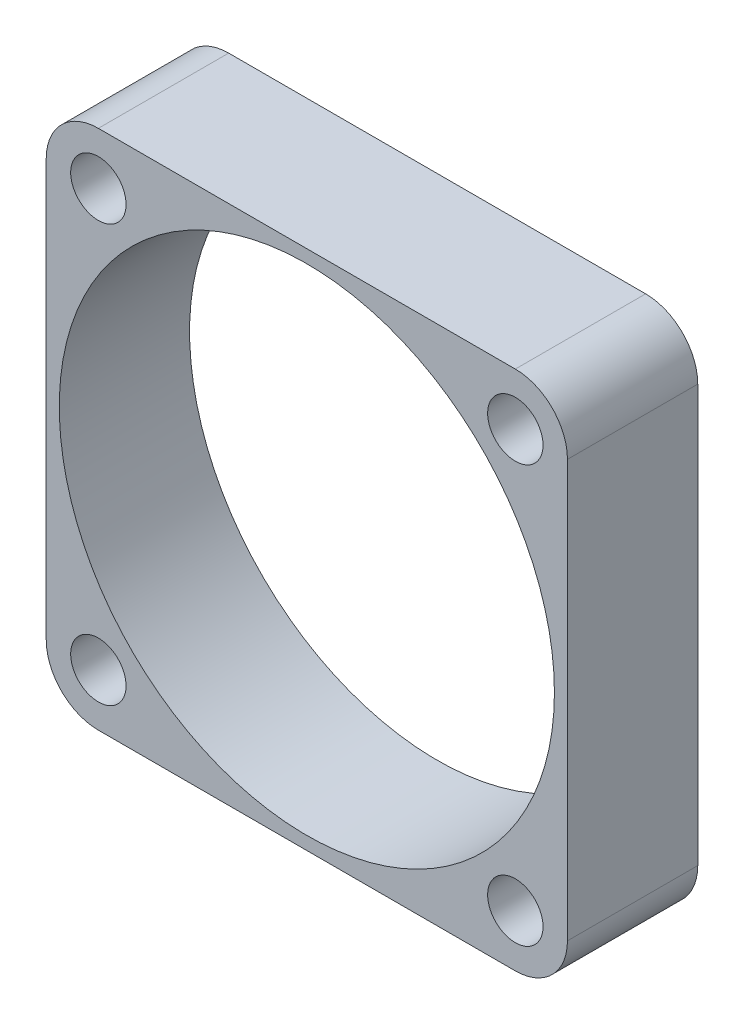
ISO-10303-21;
HEADER;
FILE_DESCRIPTION(('STEP AP214'),'2;1');
FILE_NAME('part.step','',(''),(''),'','','');
FILE_SCHEMA(('AUTOMOTIVE_DESIGN { 1 0 10303 214 1 1 1 1 }'));
ENDSEC;
DATA;
#1=APPLICATION_CONTEXT('core data for automotive mechanical design processes');
#2=APPLICATION_PROTOCOL_DEFINITION('international standard','automotive_design',2000,#1);
#3=PRODUCT_CONTEXT('',#1,'mechanical');
#4=PRODUCT('Part','Part','',(#3));
#5=PRODUCT_RELATED_PRODUCT_CATEGORY('part','',(#4));
#6=PRODUCT_DEFINITION_FORMATION('','',#4);
#7=PRODUCT_DEFINITION_CONTEXT('part definition',#1,'design');
#8=PRODUCT_DEFINITION('design','',#6,#7);
#9=PRODUCT_DEFINITION_SHAPE('','',#8);
#10=(LENGTH_UNIT() NAMED_UNIT(*) SI_UNIT(.MILLI.,.METRE.));
#11=(NAMED_UNIT(*) PLANE_ANGLE_UNIT() SI_UNIT($,.RADIAN.));
#12=(NAMED_UNIT(*) SI_UNIT($,.STERADIAN.) SOLID_ANGLE_UNIT());
#13=UNCERTAINTY_MEASURE_WITH_UNIT(LENGTH_MEASURE(1.E-05),#10,'distance_accuracy_value','');
#14=(GEOMETRIC_REPRESENTATION_CONTEXT(3) GLOBAL_UNCERTAINTY_ASSIGNED_CONTEXT((#13)) GLOBAL_UNIT_ASSIGNED_CONTEXT((#10,
#11,#12)) REPRESENTATION_CONTEXT('',''));
#15=CARTESIAN_POINT('',(0.,0.,0.));
#16=DIRECTION('',(0.,0.,1.));
#17=DIRECTION('',(1.,0.,0.));
#18=AXIS2_PLACEMENT_3D('',#15,#16,#17);
#19=CARTESIAN_POINT('',(0.,0.,10.));
#20=DIRECTION('',(0.,0.,1.));
#21=DIRECTION('',(1.,0.,0.));
#22=AXIS2_PLACEMENT_3D('',#19,#20,#21);
#23=PLANE('',#22);
#24=CARTESIAN_POINT('',(-54.6379845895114,0.,10.));
#25=DIRECTION('',(0.,0.,1.));
#26=DIRECTION('',(1.,0.,0.));
#27=AXIS2_PLACEMENT_3D('',#24,#25,#26);
#28=CIRCLE('',#27,2.125);
#29=CARTESIAN_POINT('',(-52.5129845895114,0.,10.));
#30=VERTEX_POINT('',#29);
#31=EDGE_CURVE('E192',#30,#30,#28,.T.);
#32=ORIENTED_EDGE('',*,*,#31,.F.);
#33=EDGE_LOOP('',(#32));
#34=FACE_BOUND('',#33,.T.);
#35=CARTESIAN_POINT('',(-54.6379845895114,32.,10.));
#36=DIRECTION('',(0.,0.,1.));
#37=DIRECTION('',(1.,0.,0.));
#38=AXIS2_PLACEMENT_3D('',#35,#36,#37);
#39=CIRCLE('',#38,2.125);
#40=CARTESIAN_POINT('',(-52.5129845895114,32.,10.));
#41=VERTEX_POINT('',#40);
#42=EDGE_CURVE('E180',#41,#41,#39,.T.);
#43=ORIENTED_EDGE('',*,*,#42,.F.);
#44=EDGE_LOOP('',(#43));
#45=FACE_BOUND('',#44,.T.);
#46=DIRECTION('',(0.,-1.,0.));
#47=VECTOR('',#46,1.);
#48=CARTESIAN_POINT('',(-58.6379845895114,36.,10.));
#49=LINE('',#48,#47);
#50=CARTESIAN_POINT('',(-58.6379845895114,32.,10.));
#51=VERTEX_POINT('',#50);
#52=CARTESIAN_POINT('',(-58.6379845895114,0.,10.));
#53=VERTEX_POINT('',#52);
#54=EDGE_CURVE('E137',#51,#53,#49,.T.);
#55=ORIENTED_EDGE('',*,*,#54,.T.);
#56=CARTESIAN_POINT('',(-54.6379845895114,0.,10.));
#57=DIRECTION('',(0.,0.,1.));
#58=DIRECTION('',(1.,0.,0.));
#59=AXIS2_PLACEMENT_3D('',#56,#57,#58);
#60=CIRCLE('',#59,4.);
#61=CARTESIAN_POINT('',(-54.6379845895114,-4.00000000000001,10.));
#62=VERTEX_POINT('',#61);
#63=EDGE_CURVE('E152',#53,#62,#60,.T.);
#64=ORIENTED_EDGE('',*,*,#63,.T.);
#65=DIRECTION('',(1.,0.,0.));
#66=VECTOR('',#65,1.);
#67=CARTESIAN_POINT('',(-58.6379845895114,-4.00000000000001,10.));
#68=LINE('',#67,#66);
#69=CARTESIAN_POINT('',(-22.6379845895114,-4.,10.));
#70=VERTEX_POINT('',#69);
#71=EDGE_CURVE('E119',#62,#70,#68,.T.);
#72=ORIENTED_EDGE('',*,*,#71,.T.);
#73=CARTESIAN_POINT('',(-22.6379845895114,0.,10.));
#74=DIRECTION('',(0.,0.,1.));
#75=DIRECTION('',(1.,0.,0.));
#76=AXIS2_PLACEMENT_3D('',#73,#74,#75);
#77=CIRCLE('',#76,4.);
#78=CARTESIAN_POINT('',(-18.6379845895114,0.,10.));
#79=VERTEX_POINT('',#78);
#80=EDGE_CURVE('E150',#70,#79,#77,.T.);
#81=ORIENTED_EDGE('',*,*,#80,.T.);
#82=DIRECTION('',(0.,1.,0.));
#83=VECTOR('',#82,1.);
#84=CARTESIAN_POINT('',(-18.6379845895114,36.,10.));
#85=LINE('',#84,#83);
#86=CARTESIAN_POINT('',(-18.6379845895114,32.,10.));
#87=VERTEX_POINT('',#86);
#88=EDGE_CURVE('E163',#79,#87,#85,.T.);
#89=ORIENTED_EDGE('',*,*,#88,.T.);
#90=CARTESIAN_POINT('',(-22.6379845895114,32.,10.));
#91=DIRECTION('',(0.,0.,1.));
#92=DIRECTION('',(1.,0.,0.));
#93=AXIS2_PLACEMENT_3D('',#90,#91,#92);
#94=CIRCLE('',#93,4.);
#95=CARTESIAN_POINT('',(-22.6379845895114,36.,10.));
#96=VERTEX_POINT('',#95);
#97=EDGE_CURVE('E54',#87,#96,#94,.T.);
#98=ORIENTED_EDGE('',*,*,#97,.T.);
#99=DIRECTION('',(-1.,0.,0.));
#100=VECTOR('',#99,1.);
#101=CARTESIAN_POINT('',(-58.6379845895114,36.,10.));
#102=LINE('',#101,#100);
#103=CARTESIAN_POINT('',(-54.6379845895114,36.,10.));
#104=VERTEX_POINT('',#103);
#105=EDGE_CURVE('E138',#96,#104,#102,.T.);
#106=ORIENTED_EDGE('',*,*,#105,.T.);
#107=CARTESIAN_POINT('',(-54.6379845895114,32.,10.));
#108=DIRECTION('',(0.,0.,1.));
#109=DIRECTION('',(1.,0.,0.));
#110=AXIS2_PLACEMENT_3D('',#107,#108,#109);
#111=CIRCLE('',#110,4.);
#112=EDGE_CURVE('E147',#104,#51,#111,.T.);
#113=ORIENTED_EDGE('',*,*,#112,.T.);
#114=EDGE_LOOP('',(#55,#64,#72,#81,#89,#98,#106,#113));
#115=FACE_BOUND('',#114,.T.);
#116=CARTESIAN_POINT('',(-38.6379845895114,16.,10.));
#117=DIRECTION('',(0.,0.,1.));
#118=DIRECTION('',(1.,0.,0.));
#119=AXIS2_PLACEMENT_3D('',#116,#117,#118);
#120=CIRCLE('',#119,19.);
#121=CARTESIAN_POINT('',(-19.6379845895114,16.,10.));
#122=VERTEX_POINT('',#121);
#123=EDGE_CURVE('E132',#122,#122,#120,.T.);
#124=ORIENTED_EDGE('',*,*,#123,.F.);
#125=EDGE_LOOP('',(#124));
#126=FACE_BOUND('',#125,.T.);
#127=CARTESIAN_POINT('',(-22.6379845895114,32.,10.));
#128=DIRECTION('',(0.,0.,1.));
#129=DIRECTION('',(1.,0.,0.));
#130=AXIS2_PLACEMENT_3D('',#127,#128,#129);
#131=CIRCLE('',#130,2.125);
#132=CARTESIAN_POINT('',(-20.5129845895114,32.,10.));
#133=VERTEX_POINT('',#132);
#134=EDGE_CURVE('E186',#133,#133,#131,.T.);
#135=ORIENTED_EDGE('',*,*,#134,.F.);
#136=EDGE_LOOP('',(#135));
#137=FACE_BOUND('',#136,.T.);
#138=CARTESIAN_POINT('',(-22.6379845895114,0.,10.));
#139=DIRECTION('',(0.,0.,1.));
#140=DIRECTION('',(1.,0.,0.));
#141=AXIS2_PLACEMENT_3D('',#138,#139,#140);
#142=CIRCLE('',#141,2.125);
#143=CARTESIAN_POINT('',(-20.5129845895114,0.,10.));
#144=VERTEX_POINT('',#143);
#145=EDGE_CURVE('E198',#144,#144,#142,.T.);
#146=ORIENTED_EDGE('',*,*,#145,.F.);
#147=EDGE_LOOP('',(#146));
#148=FACE_BOUND('',#147,.T.);
#149=ADVANCED_FACE('F33',(#34,#45,#115,#126,#137,#148),#23,.T.);
#150=CARTESIAN_POINT('',(0.,0.,0.));
#151=DIRECTION('',(0.,0.,1.));
#152=DIRECTION('',(1.,0.,0.));
#153=AXIS2_PLACEMENT_3D('',#150,#151,#152);
#154=PLANE('',#153);
#155=CARTESIAN_POINT('',(-54.6379845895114,0.,0.));
#156=DIRECTION('',(0.,0.,1.));
#157=DIRECTION('',(1.,0.,0.));
#158=AXIS2_PLACEMENT_3D('',#155,#156,#157);
#159=CIRCLE('',#158,2.125);
#160=CARTESIAN_POINT('',(-52.5129845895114,0.,0.));
#161=VERTEX_POINT('',#160);
#162=EDGE_CURVE('E195',#161,#161,#159,.T.);
#163=ORIENTED_EDGE('',*,*,#162,.T.);
#164=EDGE_LOOP('',(#163));
#165=FACE_BOUND('',#164,.T.);
#166=CARTESIAN_POINT('',(-54.6379845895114,32.,0.));
#167=DIRECTION('',(0.,0.,1.));
#168=DIRECTION('',(1.,0.,0.));
#169=AXIS2_PLACEMENT_3D('',#166,#167,#168);
#170=CIRCLE('',#169,2.125);
#171=CARTESIAN_POINT('',(-52.5129845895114,32.,0.));
#172=VERTEX_POINT('',#171);
#173=EDGE_CURVE('E183',#172,#172,#170,.T.);
#174=ORIENTED_EDGE('',*,*,#173,.T.);
#175=EDGE_LOOP('',(#174));
#176=FACE_BOUND('',#175,.T.);
#177=DIRECTION('',(1.,0.,0.));
#178=VECTOR('',#177,1.);
#179=CARTESIAN_POINT('',(-58.6379845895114,-4.00000000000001,0.));
#180=LINE('',#179,#178);
#181=CARTESIAN_POINT('',(-54.6379845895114,-4.00000000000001,0.));
#182=VERTEX_POINT('',#181);
#183=CARTESIAN_POINT('',(-22.6379845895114,-4.,0.));
#184=VERTEX_POINT('',#183);
#185=EDGE_CURVE('E116',#182,#184,#180,.T.);
#186=ORIENTED_EDGE('',*,*,#185,.F.);
#187=CARTESIAN_POINT('',(-54.6379845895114,0.,0.));
#188=DIRECTION('',(0.,0.,1.));
#189=DIRECTION('',(1.,0.,0.));
#190=AXIS2_PLACEMENT_3D('',#187,#188,#189);
#191=CIRCLE('',#190,4.);
#192=CARTESIAN_POINT('',(-58.6379845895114,0.,0.));
#193=VERTEX_POINT('',#192);
#194=EDGE_CURVE('E99',#182,#193,#191,.F.);
#195=ORIENTED_EDGE('',*,*,#194,.T.);
#196=DIRECTION('',(0.,-1.,0.));
#197=VECTOR('',#196,1.);
#198=CARTESIAN_POINT('',(-58.6379845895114,36.,0.));
#199=LINE('',#198,#197);
#200=CARTESIAN_POINT('',(-58.6379845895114,32.,0.));
#201=VERTEX_POINT('',#200);
#202=EDGE_CURVE('E127',#201,#193,#199,.T.);
#203=ORIENTED_EDGE('',*,*,#202,.F.);
#204=CARTESIAN_POINT('',(-54.6379845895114,32.,0.));
#205=DIRECTION('',(0.,0.,1.));
#206=DIRECTION('',(1.,0.,0.));
#207=AXIS2_PLACEMENT_3D('',#204,#205,#206);
#208=CIRCLE('',#207,4.);
#209=CARTESIAN_POINT('',(-54.6379845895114,36.,0.));
#210=VERTEX_POINT('',#209);
#211=EDGE_CURVE('E120',#201,#210,#208,.F.);
#212=ORIENTED_EDGE('',*,*,#211,.T.);
#213=DIRECTION('',(-1.,0.,0.));
#214=VECTOR('',#213,1.);
#215=CARTESIAN_POINT('',(-58.6379845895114,36.,0.));
#216=LINE('',#215,#214);
#217=CARTESIAN_POINT('',(-22.6379845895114,36.,0.));
#218=VERTEX_POINT('',#217);
#219=EDGE_CURVE('E130',#218,#210,#216,.T.);
#220=ORIENTED_EDGE('',*,*,#219,.F.);
#221=CARTESIAN_POINT('',(-22.6379845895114,32.,0.));
#222=DIRECTION('',(0.,0.,1.));
#223=DIRECTION('',(1.,0.,0.));
#224=AXIS2_PLACEMENT_3D('',#221,#222,#223);
#225=CIRCLE('',#224,4.);
#226=CARTESIAN_POINT('',(-18.6379845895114,32.,0.));
#227=VERTEX_POINT('',#226);
#228=EDGE_CURVE('E141',#218,#227,#225,.F.);
#229=ORIENTED_EDGE('',*,*,#228,.T.);
#230=DIRECTION('',(0.,1.,0.));
#231=VECTOR('',#230,1.);
#232=CARTESIAN_POINT('',(-18.6379845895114,36.,0.));
#233=LINE('',#232,#231);
#234=CARTESIAN_POINT('',(-18.6379845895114,0.,0.));
#235=VERTEX_POINT('',#234);
#236=EDGE_CURVE('E126',#235,#227,#233,.T.);
#237=ORIENTED_EDGE('',*,*,#236,.F.);
#238=CARTESIAN_POINT('',(-22.6379845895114,0.,0.));
#239=DIRECTION('',(0.,0.,1.));
#240=DIRECTION('',(1.,0.,0.));
#241=AXIS2_PLACEMENT_3D('',#238,#239,#240);
#242=CIRCLE('',#241,4.);
#243=EDGE_CURVE('E110',#235,#184,#242,.F.);
#244=ORIENTED_EDGE('',*,*,#243,.T.);
#245=EDGE_LOOP('',(#186,#195,#203,#212,#220,#229,#237,#244));
#246=FACE_BOUND('',#245,.T.);
#247=CARTESIAN_POINT('',(-38.6379845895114,16.,0.));
#248=DIRECTION('',(0.,0.,1.));
#249=DIRECTION('',(1.,0.,0.));
#250=AXIS2_PLACEMENT_3D('',#247,#248,#249);
#251=CIRCLE('',#250,19.);
#252=CARTESIAN_POINT('',(-19.6379845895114,16.,0.));
#253=VERTEX_POINT('',#252);
#254=EDGE_CURVE('E177',#253,#253,#251,.T.);
#255=ORIENTED_EDGE('',*,*,#254,.T.);
#256=EDGE_LOOP('',(#255));
#257=FACE_BOUND('',#256,.T.);
#258=CARTESIAN_POINT('',(-22.6379845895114,32.,0.));
#259=DIRECTION('',(0.,0.,1.));
#260=DIRECTION('',(1.,0.,0.));
#261=AXIS2_PLACEMENT_3D('',#258,#259,#260);
#262=CIRCLE('',#261,2.125);
#263=CARTESIAN_POINT('',(-20.5129845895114,32.,0.));
#264=VERTEX_POINT('',#263);
#265=EDGE_CURVE('E189',#264,#264,#262,.T.);
#266=ORIENTED_EDGE('',*,*,#265,.T.);
#267=EDGE_LOOP('',(#266));
#268=FACE_BOUND('',#267,.T.);
#269=CARTESIAN_POINT('',(-22.6379845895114,0.,0.));
#270=DIRECTION('',(0.,0.,1.));
#271=DIRECTION('',(1.,0.,0.));
#272=AXIS2_PLACEMENT_3D('',#269,#270,#271);
#273=CIRCLE('',#272,2.125);
#274=CARTESIAN_POINT('',(-20.5129845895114,0.,0.));
#275=VERTEX_POINT('',#274);
#276=EDGE_CURVE('E201',#275,#275,#273,.T.);
#277=ORIENTED_EDGE('',*,*,#276,.T.);
#278=EDGE_LOOP('',(#277));
#279=FACE_BOUND('',#278,.T.);
#280=ADVANCED_FACE('F123',(#165,#176,#246,#257,#268,#279),#154,.F.);
#281=CARTESIAN_POINT('',(-58.6379845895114,36.,10.));
#282=DIRECTION('',(1.,0.,0.));
#283=DIRECTION('',(0.,0.,-1.));
#284=AXIS2_PLACEMENT_3D('',#281,#282,#283);
#285=PLANE('',#284);
#286=ORIENTED_EDGE('',*,*,#202,.T.);
#287=DIRECTION('',(0.,0.,-1.));
#288=VECTOR('',#287,1.);
#289=CARTESIAN_POINT('',(-58.6379845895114,0.,10.));
#290=LINE('',#289,#288);
#291=EDGE_CURVE('E104',#193,#53,#290,.F.);
#292=ORIENTED_EDGE('',*,*,#291,.T.);
#293=ORIENTED_EDGE('',*,*,#54,.F.);
#294=DIRECTION('',(0.,0.,-1.));
#295=VECTOR('',#294,1.);
#296=CARTESIAN_POINT('',(-58.6379845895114,32.,10.));
#297=LINE('',#296,#295);
#298=EDGE_CURVE('E109',#51,#201,#297,.T.);
#299=ORIENTED_EDGE('',*,*,#298,.T.);
#300=EDGE_LOOP('',(#286,#292,#293,#299));
#301=FACE_BOUND('',#300,.T.);
#302=ADVANCED_FACE('F216',(#301),#285,.F.);
#303=CARTESIAN_POINT('',(-58.6379845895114,-4.00000000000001,10.));
#304=DIRECTION('',(0.,1.,0.));
#305=DIRECTION('',(-1.,0.,0.));
#306=AXIS2_PLACEMENT_3D('',#303,#304,#305);
#307=PLANE('',#306);
#308=ORIENTED_EDGE('',*,*,#71,.F.);
#309=DIRECTION('',(0.,0.,-1.));
#310=VECTOR('',#309,1.);
#311=CARTESIAN_POINT('',(-54.6379845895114,-4.00000000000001,10.));
#312=LINE('',#311,#310);
#313=EDGE_CURVE('E103',#62,#182,#312,.T.);
#314=ORIENTED_EDGE('',*,*,#313,.T.);
#315=ORIENTED_EDGE('',*,*,#185,.T.);
#316=DIRECTION('',(0.,0.,-1.));
#317=VECTOR('',#316,1.);
#318=CARTESIAN_POINT('',(-22.6379845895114,-4.,10.));
#319=LINE('',#318,#317);
#320=EDGE_CURVE('E121',#184,#70,#319,.F.);
#321=ORIENTED_EDGE('',*,*,#320,.T.);
#322=EDGE_LOOP('',(#308,#314,#315,#321));
#323=FACE_BOUND('',#322,.T.);
#324=ADVANCED_FACE('F115',(#323),#307,.F.);
#325=CARTESIAN_POINT('',(-18.6379845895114,36.,10.));
#326=DIRECTION('',(-1.,0.,0.));
#327=DIRECTION('',(0.,-1.,0.));
#328=AXIS2_PLACEMENT_3D('',#325,#326,#327);
#329=PLANE('',#328);
#330=ORIENTED_EDGE('',*,*,#88,.F.);
#331=DIRECTION('',(0.,0.,-1.));
#332=VECTOR('',#331,1.);
#333=CARTESIAN_POINT('',(-18.6379845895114,0.,10.));
#334=LINE('',#333,#332);
#335=EDGE_CURVE('E156',#79,#235,#334,.T.);
#336=ORIENTED_EDGE('',*,*,#335,.T.);
#337=ORIENTED_EDGE('',*,*,#236,.T.);
#338=DIRECTION('',(0.,0.,-1.));
#339=VECTOR('',#338,1.);
#340=CARTESIAN_POINT('',(-18.6379845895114,32.,10.));
#341=LINE('',#340,#339);
#342=EDGE_CURVE('E154',#227,#87,#341,.F.);
#343=ORIENTED_EDGE('',*,*,#342,.T.);
#344=EDGE_LOOP('',(#330,#336,#337,#343));
#345=FACE_BOUND('',#344,.T.);
#346=ADVANCED_FACE('F161',(#345),#329,.F.);
#347=CARTESIAN_POINT('',(-58.6379845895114,36.,10.));
#348=DIRECTION('',(0.,-1.,0.));
#349=DIRECTION('',(0.,0.,-1.));
#350=AXIS2_PLACEMENT_3D('',#347,#348,#349);
#351=PLANE('',#350);
#352=ORIENTED_EDGE('',*,*,#105,.F.);
#353=DIRECTION('',(0.,0.,-1.));
#354=VECTOR('',#353,1.);
#355=CARTESIAN_POINT('',(-22.6379845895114,36.,10.));
#356=LINE('',#355,#354);
#357=EDGE_CURVE('E11',#96,#218,#356,.T.);
#358=ORIENTED_EDGE('',*,*,#357,.T.);
#359=ORIENTED_EDGE('',*,*,#219,.T.);
#360=DIRECTION('',(0.,0.,-1.));
#361=VECTOR('',#360,1.);
#362=CARTESIAN_POINT('',(-54.6379845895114,36.,10.));
#363=LINE('',#362,#361);
#364=EDGE_CURVE('E41',#210,#104,#363,.F.);
#365=ORIENTED_EDGE('',*,*,#364,.T.);
#366=EDGE_LOOP('',(#352,#358,#359,#365));
#367=FACE_BOUND('',#366,.T.);
#368=ADVANCED_FACE('F170',(#367),#351,.F.);
#369=CARTESIAN_POINT('',(-38.6379845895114,16.,10.));
#370=DIRECTION('',(0.,0.,-1.));
#371=DIRECTION('',(-1.,0.,0.));
#372=AXIS2_PLACEMENT_3D('',#369,#370,#371);
#373=CYLINDRICAL_SURFACE('',#372,19.);
#374=ORIENTED_EDGE('',*,*,#123,.T.);
#375=EDGE_LOOP('',(#374));
#376=FACE_BOUND('',#375,.T.);
#377=ORIENTED_EDGE('',*,*,#254,.F.);
#378=EDGE_LOOP('',(#377));
#379=FACE_BOUND('',#378,.T.);
#380=ADVANCED_FACE('F222',(#376,#379),#373,.F.);
#381=CARTESIAN_POINT('',(-54.6379845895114,32.,10.));
#382=DIRECTION('',(0.,0.,-1.));
#383=DIRECTION('',(-1.,0.,0.));
#384=AXIS2_PLACEMENT_3D('',#381,#382,#383);
#385=CYLINDRICAL_SURFACE('',#384,2.125);
#386=ORIENTED_EDGE('',*,*,#42,.T.);
#387=EDGE_LOOP('',(#386));
#388=FACE_BOUND('',#387,.T.);
#389=ORIENTED_EDGE('',*,*,#173,.F.);
#390=EDGE_LOOP('',(#389));
#391=FACE_BOUND('',#390,.T.);
#392=ADVANCED_FACE('F256',(#388,#391),#385,.F.);
#393=CARTESIAN_POINT('',(-22.6379845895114,32.,10.));
#394=DIRECTION('',(0.,0.,-1.));
#395=DIRECTION('',(-1.,0.,0.));
#396=AXIS2_PLACEMENT_3D('',#393,#394,#395);
#397=CYLINDRICAL_SURFACE('',#396,2.125);
#398=ORIENTED_EDGE('',*,*,#134,.T.);
#399=EDGE_LOOP('',(#398));
#400=FACE_BOUND('',#399,.T.);
#401=ORIENTED_EDGE('',*,*,#265,.F.);
#402=EDGE_LOOP('',(#401));
#403=FACE_BOUND('',#402,.T.);
#404=ADVANCED_FACE('F252',(#400,#403),#397,.F.);
#405=CARTESIAN_POINT('',(-54.6379845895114,0.,10.));
#406=DIRECTION('',(0.,0.,-1.));
#407=DIRECTION('',(-1.,0.,0.));
#408=AXIS2_PLACEMENT_3D('',#405,#406,#407);
#409=CYLINDRICAL_SURFACE('',#408,2.125);
#410=ORIENTED_EDGE('',*,*,#31,.T.);
#411=EDGE_LOOP('',(#410));
#412=FACE_BOUND('',#411,.T.);
#413=ORIENTED_EDGE('',*,*,#162,.F.);
#414=EDGE_LOOP('',(#413));
#415=FACE_BOUND('',#414,.T.);
#416=ADVANCED_FACE('F255',(#412,#415),#409,.F.);
#417=CARTESIAN_POINT('',(-22.6379845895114,0.,10.));
#418=DIRECTION('',(0.,0.,-1.));
#419=DIRECTION('',(-1.,0.,0.));
#420=AXIS2_PLACEMENT_3D('',#417,#418,#419);
#421=CYLINDRICAL_SURFACE('',#420,2.125);
#422=ORIENTED_EDGE('',*,*,#145,.T.);
#423=EDGE_LOOP('',(#422));
#424=FACE_BOUND('',#423,.T.);
#425=ORIENTED_EDGE('',*,*,#276,.F.);
#426=EDGE_LOOP('',(#425));
#427=FACE_BOUND('',#426,.T.);
#428=ADVANCED_FACE('F207',(#424,#427),#421,.F.);
#429=CARTESIAN_POINT('',(-54.6379845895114,0.,10.));
#430=DIRECTION('',(0.,0.,-1.));
#431=DIRECTION('',(-1.,0.,0.));
#432=AXIS2_PLACEMENT_3D('',#429,#430,#431);
#433=CYLINDRICAL_SURFACE('',#432,4.);
#434=ORIENTED_EDGE('',*,*,#63,.F.);
#435=ORIENTED_EDGE('',*,*,#291,.F.);
#436=ORIENTED_EDGE('',*,*,#194,.F.);
#437=ORIENTED_EDGE('',*,*,#313,.F.);
#438=EDGE_LOOP('',(#434,#435,#436,#437));
#439=FACE_BOUND('',#438,.T.);
#440=ADVANCED_FACE('F102',(#439),#433,.T.);
#441=CARTESIAN_POINT('',(-22.6379845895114,0.,10.));
#442=DIRECTION('',(0.,0.,-1.));
#443=DIRECTION('',(-1.,0.,0.));
#444=AXIS2_PLACEMENT_3D('',#441,#442,#443);
#445=CYLINDRICAL_SURFACE('',#444,4.);
#446=ORIENTED_EDGE('',*,*,#80,.F.);
#447=ORIENTED_EDGE('',*,*,#320,.F.);
#448=ORIENTED_EDGE('',*,*,#243,.F.);
#449=ORIENTED_EDGE('',*,*,#335,.F.);
#450=EDGE_LOOP('',(#446,#447,#448,#449));
#451=FACE_BOUND('',#450,.T.);
#452=ADVANCED_FACE('F236',(#451),#445,.T.);
#453=CARTESIAN_POINT('',(-22.6379845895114,32.,10.));
#454=DIRECTION('',(0.,0.,-1.));
#455=DIRECTION('',(-1.,0.,0.));
#456=AXIS2_PLACEMENT_3D('',#453,#454,#455);
#457=CYLINDRICAL_SURFACE('',#456,4.);
#458=ORIENTED_EDGE('',*,*,#97,.F.);
#459=ORIENTED_EDGE('',*,*,#342,.F.);
#460=ORIENTED_EDGE('',*,*,#228,.F.);
#461=ORIENTED_EDGE('',*,*,#357,.F.);
#462=EDGE_LOOP('',(#458,#459,#460,#461));
#463=FACE_BOUND('',#462,.T.);
#464=ADVANCED_FACE('F169',(#463),#457,.T.);
#465=CARTESIAN_POINT('',(-54.6379845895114,32.,10.));
#466=DIRECTION('',(0.,0.,-1.));
#467=DIRECTION('',(-1.,0.,0.));
#468=AXIS2_PLACEMENT_3D('',#465,#466,#467);
#469=CYLINDRICAL_SURFACE('',#468,4.);
#470=ORIENTED_EDGE('',*,*,#112,.F.);
#471=ORIENTED_EDGE('',*,*,#364,.F.);
#472=ORIENTED_EDGE('',*,*,#211,.F.);
#473=ORIENTED_EDGE('',*,*,#298,.F.);
#474=EDGE_LOOP('',(#470,#471,#472,#473));
#475=FACE_BOUND('',#474,.T.);
#476=ADVANCED_FACE('F35',(#475),#469,.T.);
#477=CLOSED_SHELL('',(#149,#280,#302,#324,#346,#368,#380,#392,#404,#416,#428,#440,#452,#464,#476));
#478=MANIFOLD_SOLID_BREP('B2',#477);
#479=ADVANCED_BREP_SHAPE_REPRESENTATION('',(#18,#478),#14);
#480=SHAPE_DEFINITION_REPRESENTATION(#9,#479);
ENDSEC;
END-ISO-10303-21;
